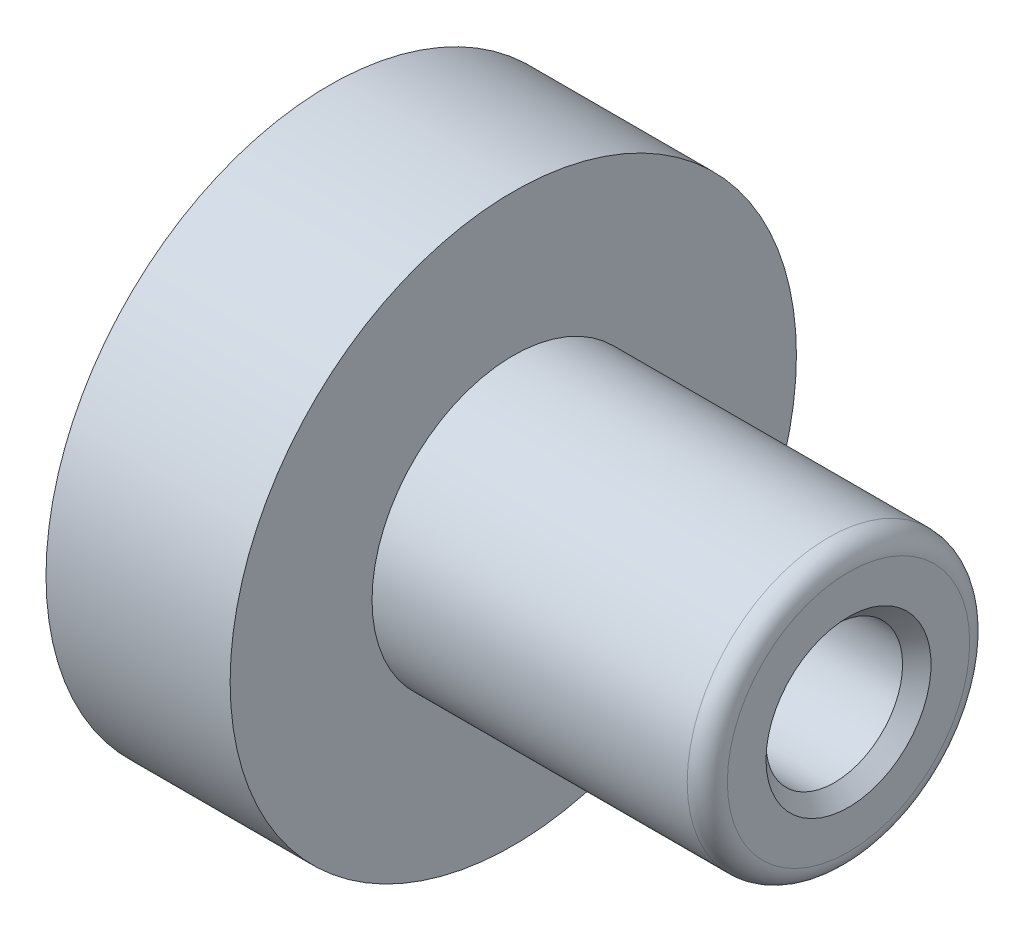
from build123d import *

# Parameters (mm, degrees)
SKETCH2_R          = 3.2004
CUT_EXTRUDE1_DEPTH = 7.9502
SKETCH3_R          = 5.3594
CUT_EXTRUDE2_DEPTH = 52.476689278
CHAMFER1_SIZE      = 1.1176


with BuildPart() as part:
    # Sketch1 → Revolve1 (revolve)
    with BuildSketch(Plane.XY, mode=Mode.PRIVATE) as revolve1_sk:
        with BuildLine():
            Line((0, 8.128), (0, 22.225))
            Line((0, 22.225), (14.4526, 22.225))
            Line((14.4526, 22.225), (14.4526, 11.0871))
            Line((14.4526, 11.0871), (39.1922, 11.0871))
            ThreePointArc((39.1922, 11.0871), (40.305751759, 10.625851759), (40.767, 9.5123))
            Line((40.767, 9.5123), (40.767, 0))
            Line((40.767, 0), (28.067, 0))
            Line((28.067, 0), (28.067, 8.128))
            Line((28.067, 8.128), (0, 8.128))
        make_face()
    revolve(revolve1_sk.sketch.rotate(Axis((0, 0, 0), (1, 0, 0)), 90), axis=Axis((0, 0, 0), (1, 0, 0)))

    # Sketch2 → Cut-Extrude1 (cut)
    with BuildSketch(Plane.ZY):
        with Locations((-12.7, 0)):
            Circle(SKETCH2_R)
        with Locations(Location((12.7, 0, 0), (0, 0, 180))):
            Circle(SKETCH2_R)
    extrude(amount=-CUT_EXTRUDE1_DEPTH, mode=Mode.SUBTRACT)

    # Sketch3 → Cut-Extrude2 (cut, through all)
    with BuildSketch(Plane(origin=(40.767, 0, 0), x_dir=(0, 0, -1), z_dir=(1, 0, 0))):
        Circle(SKETCH3_R)
    extrude(amount=-CUT_EXTRUDE2_DEPTH, mode=Mode.SUBTRACT)

    # Chamfer1
    chamfer1_edges = [part.edges().sort_by_distance(p)[0] for p in [
        (40.767, 0, 5.3594),
    ]]
    chamfer(chamfer1_edges, length=CHAMFER1_SIZE)


solid = part.part
